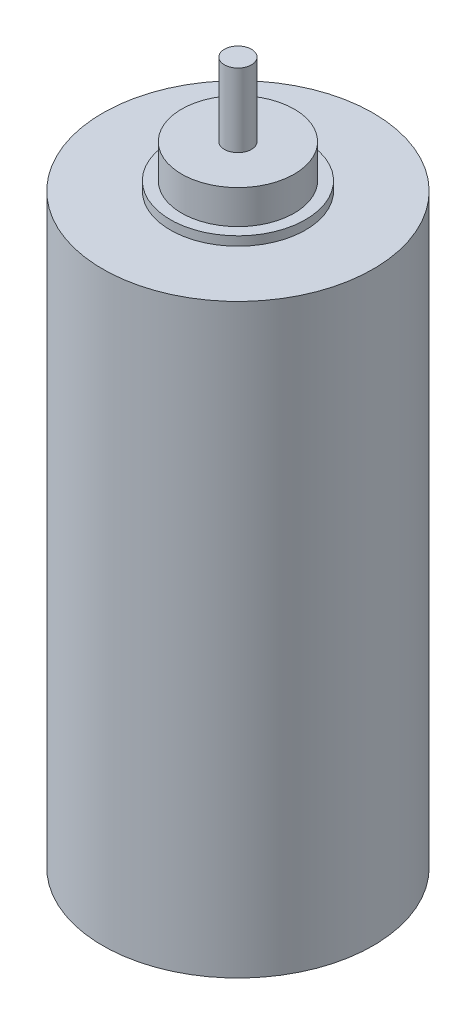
ISO-10303-21;
HEADER;
FILE_DESCRIPTION(('STEP AP214'),'2;1');
FILE_NAME('part.step','',(''),(''),'','','');
FILE_SCHEMA(('AUTOMOTIVE_DESIGN { 1 0 10303 214 1 1 1 1 }'));
ENDSEC;
DATA;
#1=APPLICATION_CONTEXT('core data for automotive mechanical design processes');
#2=APPLICATION_PROTOCOL_DEFINITION('international standard','automotive_design',2000,#1);
#3=PRODUCT_CONTEXT('',#1,'mechanical');
#4=PRODUCT('Part','Part','',(#3));
#5=PRODUCT_RELATED_PRODUCT_CATEGORY('part','',(#4));
#6=PRODUCT_DEFINITION_FORMATION('','',#4);
#7=PRODUCT_DEFINITION_CONTEXT('part definition',#1,'design');
#8=PRODUCT_DEFINITION('design','',#6,#7);
#9=PRODUCT_DEFINITION_SHAPE('','',#8);
#10=(LENGTH_UNIT() NAMED_UNIT(*) SI_UNIT(.MILLI.,.METRE.));
#11=(NAMED_UNIT(*) PLANE_ANGLE_UNIT() SI_UNIT($,.RADIAN.));
#12=(NAMED_UNIT(*) SI_UNIT($,.STERADIAN.) SOLID_ANGLE_UNIT());
#13=UNCERTAINTY_MEASURE_WITH_UNIT(LENGTH_MEASURE(1.E-05),#10,'distance_accuracy_value','');
#14=(GEOMETRIC_REPRESENTATION_CONTEXT(3) GLOBAL_UNCERTAINTY_ASSIGNED_CONTEXT((#13)) GLOBAL_UNIT_ASSIGNED_CONTEXT((#10,
#11,#12)) REPRESENTATION_CONTEXT('',''));
#15=CARTESIAN_POINT('',(0.,0.,0.));
#16=DIRECTION('',(0.,0.,1.));
#17=DIRECTION('',(1.,0.,0.));
#18=AXIS2_PLACEMENT_3D('',#15,#16,#17);
#19=CARTESIAN_POINT('',(-0.6,31.15,0.));
#20=DIRECTION('',(0.,-1.,0.));
#21=DIRECTION('',(0.,0.,-1.));
#22=AXIS2_PLACEMENT_3D('',#19,#20,#21);
#23=PLANE('',#22);
#24=CARTESIAN_POINT('',(0.,31.15,0.));
#25=DIRECTION('',(0.,-1.,0.));
#26=DIRECTION('',(0.,0.,-1.));
#27=AXIS2_PLACEMENT_3D('',#24,#25,#26);
#28=CIRCLE('',#27,0.6);
#29=CARTESIAN_POINT('',(0.,31.15,-0.6));
#30=VERTEX_POINT('',#29);
#31=EDGE_CURVE('E18',#30,#30,#28,.T.);
#32=ORIENTED_EDGE('',*,*,#31,.F.);
#33=EDGE_LOOP('',(#32));
#34=FACE_BOUND('',#33,.T.);
#35=ADVANCED_FACE('F15',(#34),#23,.F.);
#36=CARTESIAN_POINT('',(0.,0.,0.));
#37=DIRECTION('',(0.,-1.,0.));
#38=DIRECTION('',(0.,0.,-1.));
#39=AXIS2_PLACEMENT_3D('',#36,#37,#38);
#40=CYLINDRICAL_SURFACE('',#39,0.6);
#41=CARTESIAN_POINT('',(0.,27.9,0.));
#42=DIRECTION('',(0.,-1.,0.));
#43=DIRECTION('',(0.,0.,-1.));
#44=AXIS2_PLACEMENT_3D('',#41,#42,#43);
#45=CIRCLE('',#44,0.6);
#46=CARTESIAN_POINT('',(0.,27.9,-0.6));
#47=VERTEX_POINT('',#46);
#48=EDGE_CURVE('E40',#47,#47,#45,.F.);
#49=ORIENTED_EDGE('',*,*,#48,.T.);
#50=EDGE_LOOP('',(#49));
#51=FACE_BOUND('',#50,.T.);
#52=ORIENTED_EDGE('',*,*,#31,.T.);
#53=EDGE_LOOP('',(#52));
#54=FACE_BOUND('',#53,.T.);
#55=ADVANCED_FACE('F47',(#51,#54),#40,.T.);
#56=CARTESIAN_POINT('',(-2.5,27.9,0.));
#57=DIRECTION('',(0.,-1.,0.));
#58=DIRECTION('',(0.,0.,-1.));
#59=AXIS2_PLACEMENT_3D('',#56,#57,#58);
#60=PLANE('',#59);
#61=ORIENTED_EDGE('',*,*,#48,.F.);
#62=EDGE_LOOP('',(#61));
#63=FACE_BOUND('',#62,.T.);
#64=CARTESIAN_POINT('',(0.,27.9,0.));
#65=DIRECTION('',(0.,-1.,0.));
#66=DIRECTION('',(0.,0.,-1.));
#67=AXIS2_PLACEMENT_3D('',#64,#65,#66);
#68=CIRCLE('',#67,2.5);
#69=CARTESIAN_POINT('',(0.,27.9,-2.5));
#70=VERTEX_POINT('',#69);
#71=EDGE_CURVE('E38',#70,#70,#68,.T.);
#72=ORIENTED_EDGE('',*,*,#71,.F.);
#73=EDGE_LOOP('',(#72));
#74=FACE_BOUND('',#73,.T.);
#75=ADVANCED_FACE('F54',(#63,#74),#60,.F.);
#76=CARTESIAN_POINT('',(0.,0.,0.));
#77=DIRECTION('',(0.,-1.,0.));
#78=DIRECTION('',(0.,0.,-1.));
#79=AXIS2_PLACEMENT_3D('',#76,#77,#78);
#80=CYLINDRICAL_SURFACE('',#79,2.5);
#81=CARTESIAN_POINT('',(0.,26.4,0.));
#82=DIRECTION('',(0.,-1.,0.));
#83=DIRECTION('',(0.,0.,-1.));
#84=AXIS2_PLACEMENT_3D('',#81,#82,#83);
#85=CIRCLE('',#84,2.5);
#86=CARTESIAN_POINT('',(0.,26.4,-2.5));
#87=VERTEX_POINT('',#86);
#88=EDGE_CURVE('E35',#87,#87,#85,.F.);
#89=ORIENTED_EDGE('',*,*,#88,.T.);
#90=EDGE_LOOP('',(#89));
#91=FACE_BOUND('',#90,.T.);
#92=ORIENTED_EDGE('',*,*,#71,.T.);
#93=EDGE_LOOP('',(#92));
#94=FACE_BOUND('',#93,.T.);
#95=ADVANCED_FACE('F77',(#91,#94),#80,.T.);
#96=CARTESIAN_POINT('',(-3.,26.4,0.));
#97=DIRECTION('',(0.,-1.,0.));
#98=DIRECTION('',(0.,0.,-1.));
#99=AXIS2_PLACEMENT_3D('',#96,#97,#98);
#100=PLANE('',#99);
#101=ORIENTED_EDGE('',*,*,#88,.F.);
#102=EDGE_LOOP('',(#101));
#103=FACE_BOUND('',#102,.T.);
#104=CARTESIAN_POINT('',(0.,26.4,0.));
#105=DIRECTION('',(0.,-1.,0.));
#106=DIRECTION('',(0.,0.,-1.));
#107=AXIS2_PLACEMENT_3D('',#104,#105,#106);
#108=CIRCLE('',#107,3.);
#109=CARTESIAN_POINT('',(0.,26.4,-3.));
#110=VERTEX_POINT('',#109);
#111=EDGE_CURVE('E32',#110,#110,#108,.T.);
#112=ORIENTED_EDGE('',*,*,#111,.F.);
#113=EDGE_LOOP('',(#112));
#114=FACE_BOUND('',#113,.T.);
#115=ADVANCED_FACE('F73',(#103,#114),#100,.F.);
#116=CARTESIAN_POINT('',(0.,0.,0.));
#117=DIRECTION('',(0.,-1.,0.));
#118=DIRECTION('',(0.,0.,-1.));
#119=AXIS2_PLACEMENT_3D('',#116,#117,#118);
#120=CYLINDRICAL_SURFACE('',#119,3.);
#121=CARTESIAN_POINT('',(0.,26.,0.));
#122=DIRECTION('',(0.,-1.,0.));
#123=DIRECTION('',(0.,0.,-1.));
#124=AXIS2_PLACEMENT_3D('',#121,#122,#123);
#125=CIRCLE('',#124,3.);
#126=CARTESIAN_POINT('',(0.,26.,-3.));
#127=VERTEX_POINT('',#126);
#128=EDGE_CURVE('E27',#127,#127,#125,.F.);
#129=ORIENTED_EDGE('',*,*,#128,.T.);
#130=EDGE_LOOP('',(#129));
#131=FACE_BOUND('',#130,.T.);
#132=ORIENTED_EDGE('',*,*,#111,.T.);
#133=EDGE_LOOP('',(#132));
#134=FACE_BOUND('',#133,.T.);
#135=ADVANCED_FACE('F69',(#131,#134),#120,.T.);
#136=CARTESIAN_POINT('',(-6.,26.,0.));
#137=DIRECTION('',(0.,-1.,0.));
#138=DIRECTION('',(0.,0.,-1.));
#139=AXIS2_PLACEMENT_3D('',#136,#137,#138);
#140=PLANE('',#139);
#141=ORIENTED_EDGE('',*,*,#128,.F.);
#142=EDGE_LOOP('',(#141));
#143=FACE_BOUND('',#142,.T.);
#144=CARTESIAN_POINT('',(0.,26.,0.));
#145=DIRECTION('',(0.,-1.,0.));
#146=DIRECTION('',(0.,0.,-1.));
#147=AXIS2_PLACEMENT_3D('',#144,#145,#146);
#148=CIRCLE('',#147,6.);
#149=CARTESIAN_POINT('',(0.,26.,-6.));
#150=VERTEX_POINT('',#149);
#151=EDGE_CURVE('E22',#150,#150,#148,.T.);
#152=ORIENTED_EDGE('',*,*,#151,.F.);
#153=EDGE_LOOP('',(#152));
#154=FACE_BOUND('',#153,.T.);
#155=ADVANCED_FACE('F62',(#143,#154),#140,.F.);
#156=CARTESIAN_POINT('',(0.,0.,0.));
#157=DIRECTION('',(0.,1.,0.));
#158=DIRECTION('',(0.,0.,1.));
#159=AXIS2_PLACEMENT_3D('',#156,#157,#158);
#160=PLANE('',#159);
#161=CARTESIAN_POINT('',(0.,0.,0.));
#162=DIRECTION('',(0.,-1.,0.));
#163=DIRECTION('',(0.,0.,-1.));
#164=AXIS2_PLACEMENT_3D('',#161,#162,#163);
#165=CIRCLE('',#164,6.);
#166=CARTESIAN_POINT('',(0.,0.,-6.));
#167=VERTEX_POINT('',#166);
#168=EDGE_CURVE('E10',#167,#167,#165,.F.);
#169=ORIENTED_EDGE('',*,*,#168,.F.);
#170=EDGE_LOOP('',(#169));
#171=FACE_BOUND('',#170,.T.);
#172=ADVANCED_FACE('F57',(#171),#160,.F.);
#173=CARTESIAN_POINT('',(0.,0.,0.));
#174=DIRECTION('',(0.,-1.,0.));
#175=DIRECTION('',(0.,0.,-1.));
#176=AXIS2_PLACEMENT_3D('',#173,#174,#175);
#177=CYLINDRICAL_SURFACE('',#176,6.);
#178=ORIENTED_EDGE('',*,*,#168,.T.);
#179=EDGE_LOOP('',(#178));
#180=FACE_BOUND('',#179,.T.);
#181=ORIENTED_EDGE('',*,*,#151,.T.);
#182=EDGE_LOOP('',(#181));
#183=FACE_BOUND('',#182,.T.);
#184=ADVANCED_FACE('F55',(#180,#183),#177,.T.);
#185=CLOSED_SHELL('',(#35,#55,#75,#95,#115,#135,#155,#172,#184));
#186=MANIFOLD_SOLID_BREP('B1',#185);
#187=ADVANCED_BREP_SHAPE_REPRESENTATION('',(#18,#186),#14);
#188=SHAPE_DEFINITION_REPRESENTATION(#9,#187);
ENDSEC;
END-ISO-10303-21;
